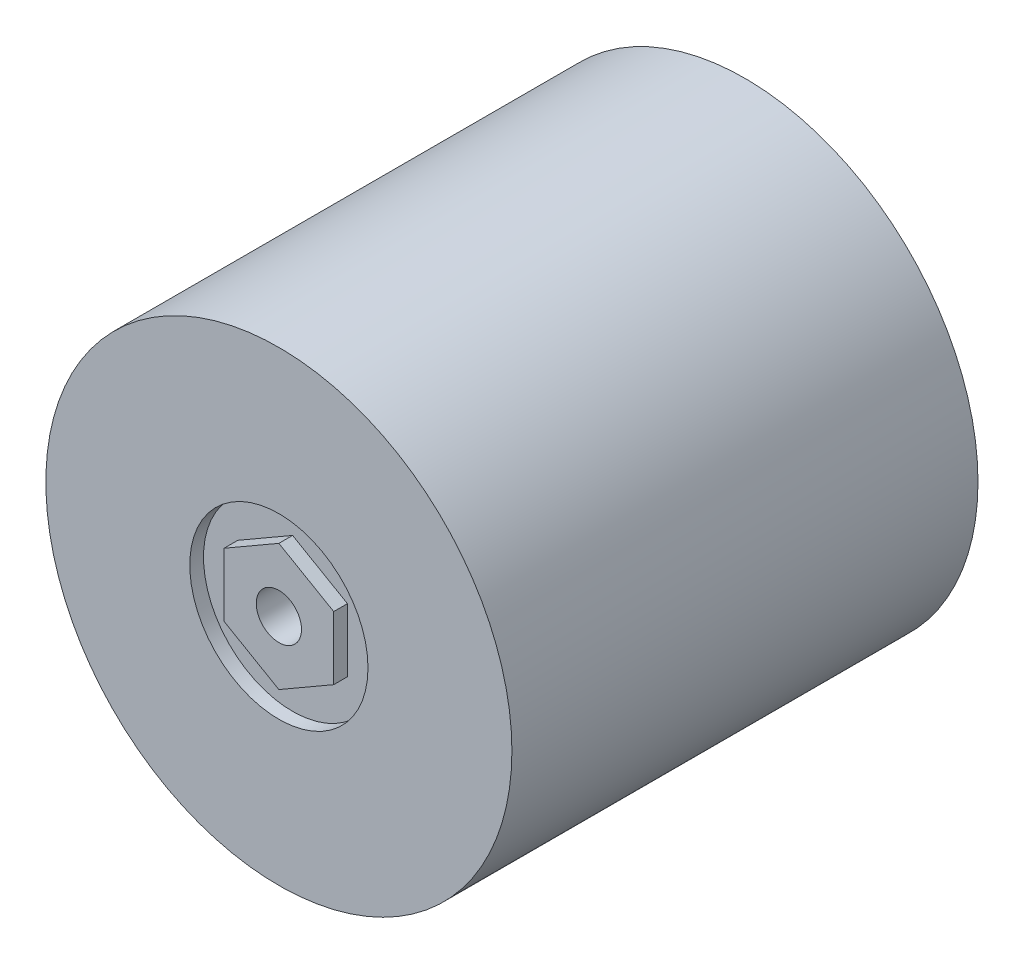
ISO-10303-21;
HEADER;
FILE_DESCRIPTION(('STEP AP214'),'2;1');
FILE_NAME('part.step','',(''),(''),'','','');
FILE_SCHEMA(('AUTOMOTIVE_DESIGN { 1 0 10303 214 1 1 1 1 }'));
ENDSEC;
DATA;
#1=APPLICATION_CONTEXT('core data for automotive mechanical design processes');
#2=APPLICATION_PROTOCOL_DEFINITION('international standard','automotive_design',2000,#1);
#3=PRODUCT_CONTEXT('',#1,'mechanical');
#4=PRODUCT('Part','Part','',(#3));
#5=PRODUCT_RELATED_PRODUCT_CATEGORY('part','',(#4));
#6=PRODUCT_DEFINITION_FORMATION('','',#4);
#7=PRODUCT_DEFINITION_CONTEXT('part definition',#1,'design');
#8=PRODUCT_DEFINITION('design','',#6,#7);
#9=PRODUCT_DEFINITION_SHAPE('','',#8);
#10=(LENGTH_UNIT() NAMED_UNIT(*) SI_UNIT(.MILLI.,.METRE.));
#11=(NAMED_UNIT(*) PLANE_ANGLE_UNIT() SI_UNIT($,.RADIAN.));
#12=(NAMED_UNIT(*) SI_UNIT($,.STERADIAN.) SOLID_ANGLE_UNIT());
#13=UNCERTAINTY_MEASURE_WITH_UNIT(LENGTH_MEASURE(1.E-05),#10,'distance_accuracy_value','');
#14=(GEOMETRIC_REPRESENTATION_CONTEXT(3) GLOBAL_UNCERTAINTY_ASSIGNED_CONTEXT((#13)) GLOBAL_UNIT_ASSIGNED_CONTEXT((#10,
#11,#12)) REPRESENTATION_CONTEXT('',''));
#15=CARTESIAN_POINT('',(0.,0.,0.));
#16=DIRECTION('',(0.,0.,1.));
#17=DIRECTION('',(1.,0.,0.));
#18=AXIS2_PLACEMENT_3D('',#15,#16,#17);
#19=CARTESIAN_POINT('',(0.,0.,34.));
#20=DIRECTION('',(0.,0.,1.));
#21=DIRECTION('',(1.,0.,0.));
#22=AXIS2_PLACEMENT_3D('',#19,#20,#21);
#23=PLANE('',#22);
#24=CARTESIAN_POINT('',(0.,0.,34.));
#25=DIRECTION('',(0.,0.,1.));
#26=DIRECTION('',(1.,0.,0.));
#27=AXIS2_PLACEMENT_3D('',#24,#25,#26);
#28=CIRCLE('',#27,6.5);
#29=CARTESIAN_POINT('',(6.5,0.,34.));
#30=VERTEX_POINT('',#29);
#31=EDGE_CURVE('E119',#30,#30,#28,.T.);
#32=ORIENTED_EDGE('',*,*,#31,.F.);
#33=EDGE_LOOP('',(#32));
#34=FACE_BOUND('',#33,.T.);
#35=CARTESIAN_POINT('',(0.,0.,34.));
#36=DIRECTION('',(0.,0.,1.));
#37=DIRECTION('',(1.,0.,0.));
#38=AXIS2_PLACEMENT_3D('',#35,#36,#37);
#39=CIRCLE('',#38,17.);
#40=CARTESIAN_POINT('',(17.,0.,34.));
#41=VERTEX_POINT('',#40);
#42=EDGE_CURVE('E19',#41,#41,#39,.F.);
#43=ORIENTED_EDGE('',*,*,#42,.F.);
#44=EDGE_LOOP('',(#43));
#45=FACE_BOUND('',#44,.T.);
#46=ADVANCED_FACE('F16',(#34,#45),#23,.T.);
#47=CARTESIAN_POINT('',(0.,0.,0.));
#48=DIRECTION('',(0.,0.,1.));
#49=DIRECTION('',(1.,0.,0.));
#50=AXIS2_PLACEMENT_3D('',#47,#48,#49);
#51=PLANE('',#50);
#52=CARTESIAN_POINT('',(0.,0.,0.));
#53=DIRECTION('',(0.,0.,-1.));
#54=DIRECTION('',(-1.,0.,0.));
#55=AXIS2_PLACEMENT_3D('',#52,#53,#54);
#56=CIRCLE('',#55,15.);
#57=CARTESIAN_POINT('',(-15.,0.,0.));
#58=VERTEX_POINT('',#57);
#59=EDGE_CURVE('E142',#58,#58,#56,.T.);
#60=ORIENTED_EDGE('',*,*,#59,.F.);
#61=EDGE_LOOP('',(#60));
#62=FACE_BOUND('',#61,.T.);
#63=CARTESIAN_POINT('',(0.,0.,0.));
#64=DIRECTION('',(0.,0.,1.));
#65=DIRECTION('',(1.,0.,0.));
#66=AXIS2_PLACEMENT_3D('',#63,#64,#65);
#67=CIRCLE('',#66,17.);
#68=CARTESIAN_POINT('',(17.,0.,0.));
#69=VERTEX_POINT('',#68);
#70=EDGE_CURVE('E11',#69,#69,#67,.T.);
#71=ORIENTED_EDGE('',*,*,#70,.F.);
#72=EDGE_LOOP('',(#71));
#73=FACE_BOUND('',#72,.T.);
#74=ADVANCED_FACE('F153',(#62,#73),#51,.F.);
#75=CARTESIAN_POINT('',(0.,0.,34.));
#76=DIRECTION('',(0.,0.,1.));
#77=DIRECTION('',(1.,0.,0.));
#78=AXIS2_PLACEMENT_3D('',#75,#76,#77);
#79=CYLINDRICAL_SURFACE('',#78,17.);
#80=ORIENTED_EDGE('',*,*,#70,.T.);
#81=EDGE_LOOP('',(#80));
#82=FACE_BOUND('',#81,.T.);
#83=ORIENTED_EDGE('',*,*,#42,.T.);
#84=EDGE_LOOP('',(#83));
#85=FACE_BOUND('',#84,.T.);
#86=ADVANCED_FACE('F156',(#82,#85),#79,.T.);
#87=CARTESIAN_POINT('',(0.,0.,1.));
#88=DIRECTION('',(0.,0.,-1.));
#89=DIRECTION('',(-1.,0.,0.));
#90=AXIS2_PLACEMENT_3D('',#87,#88,#89);
#91=CYLINDRICAL_SURFACE('',#90,15.);
#92=CARTESIAN_POINT('',(0.,0.,1.));
#93=DIRECTION('',(0.,0.,-1.));
#94=DIRECTION('',(-1.,0.,0.));
#95=AXIS2_PLACEMENT_3D('',#92,#93,#94);
#96=CIRCLE('',#95,15.);
#97=CARTESIAN_POINT('',(-15.,0.,1.));
#98=VERTEX_POINT('',#97);
#99=EDGE_CURVE('E145',#98,#98,#96,.T.);
#100=ORIENTED_EDGE('',*,*,#99,.F.);
#101=EDGE_LOOP('',(#100));
#102=FACE_BOUND('',#101,.T.);
#103=ORIENTED_EDGE('',*,*,#59,.T.);
#104=EDGE_LOOP('',(#103));
#105=FACE_BOUND('',#104,.T.);
#106=ADVANCED_FACE('F151',(#102,#105),#91,.F.);
#107=CARTESIAN_POINT('',(0.,0.,1.));
#108=DIRECTION('',(0.,0.,-1.));
#109=DIRECTION('',(-1.,0.,0.));
#110=AXIS2_PLACEMENT_3D('',#107,#108,#109);
#111=PLANE('',#110);
#112=CARTESIAN_POINT('',(0.,0.,1.));
#113=DIRECTION('',(0.,0.,-1.));
#114=DIRECTION('',(-1.,0.,0.));
#115=AXIS2_PLACEMENT_3D('',#112,#113,#114);
#116=CIRCLE('',#115,7.);
#117=CARTESIAN_POINT('',(-7.,0.,1.));
#118=VERTEX_POINT('',#117);
#119=EDGE_CURVE('E139',#118,#118,#116,.T.);
#120=ORIENTED_EDGE('',*,*,#119,.F.);
#121=EDGE_LOOP('',(#120));
#122=FACE_BOUND('',#121,.T.);
#123=ORIENTED_EDGE('',*,*,#99,.T.);
#124=EDGE_LOOP('',(#123));
#125=FACE_BOUND('',#124,.T.);
#126=ADVANCED_FACE('F178',(#122,#125),#111,.T.);
#127=CARTESIAN_POINT('',(0.,0.,1.));
#128=DIRECTION('',(0.,0.,-1.));
#129=DIRECTION('',(-1.,0.,0.));
#130=AXIS2_PLACEMENT_3D('',#127,#128,#129);
#131=CYLINDRICAL_SURFACE('',#130,7.);
#132=ORIENTED_EDGE('',*,*,#119,.T.);
#133=EDGE_LOOP('',(#132));
#134=FACE_BOUND('',#133,.T.);
#135=CARTESIAN_POINT('',(0.,0.,0.));
#136=DIRECTION('',(0.,0.,-1.));
#137=DIRECTION('',(-1.,0.,0.));
#138=AXIS2_PLACEMENT_3D('',#135,#136,#137);
#139=CIRCLE('',#138,7.);
#140=CARTESIAN_POINT('',(-7.,0.,0.));
#141=VERTEX_POINT('',#140);
#142=EDGE_CURVE('E138',#141,#141,#139,.T.);
#143=ORIENTED_EDGE('',*,*,#142,.F.);
#144=EDGE_LOOP('',(#143));
#145=FACE_BOUND('',#144,.T.);
#146=ADVANCED_FACE('F185',(#134,#145),#131,.T.);
#147=ORIENTED_EDGE('',*,*,#142,.T.);
#148=EDGE_LOOP('',(#147));
#149=FACE_BOUND('',#148,.T.);
#150=ADVANCED_FACE('F157',(#149),#51,.F.);
#151=CARTESIAN_POINT('',(0.,0.,33.));
#152=DIRECTION('',(0.,0.,1.));
#153=DIRECTION('',(1.,0.,0.));
#154=AXIS2_PLACEMENT_3D('',#151,#152,#153);
#155=CYLINDRICAL_SURFACE('',#154,6.5);
#156=CARTESIAN_POINT('',(0.,0.,33.));
#157=DIRECTION('',(0.,0.,1.));
#158=DIRECTION('',(1.,0.,0.));
#159=AXIS2_PLACEMENT_3D('',#156,#157,#158);
#160=CIRCLE('',#159,6.5);
#161=CARTESIAN_POINT('',(6.5,0.,33.));
#162=VERTEX_POINT('',#161);
#163=EDGE_CURVE('E127',#162,#162,#160,.T.);
#164=ORIENTED_EDGE('',*,*,#163,.F.);
#165=EDGE_LOOP('',(#164));
#166=FACE_BOUND('',#165,.T.);
#167=ORIENTED_EDGE('',*,*,#31,.T.);
#168=EDGE_LOOP('',(#167));
#169=FACE_BOUND('',#168,.T.);
#170=ADVANCED_FACE('F199',(#166,#169),#155,.F.);
#171=CARTESIAN_POINT('',(0.,0.,33.));
#172=DIRECTION('',(0.,0.,1.));
#173=DIRECTION('',(1.,0.,0.));
#174=AXIS2_PLACEMENT_3D('',#171,#172,#173);
#175=PLANE('',#174);
#176=DIRECTION('',(0.,-1.,0.));
#177=VECTOR('',#176,1.);
#178=CARTESIAN_POINT('',(-4.,2.30940107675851,33.));
#179=LINE('',#178,#177);
#180=CARTESIAN_POINT('',(-4.,2.30940107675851,33.));
#181=VERTEX_POINT('',#180);
#182=CARTESIAN_POINT('',(-4.,-2.30940107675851,33.));
#183=VERTEX_POINT('',#182);
#184=EDGE_CURVE('E80',#181,#183,#179,.T.);
#185=ORIENTED_EDGE('',*,*,#184,.F.);
#186=DIRECTION('',(-0.866025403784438,-0.5,0.));
#187=VECTOR('',#186,1.);
#188=CARTESIAN_POINT('',(0.,4.61880215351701,33.));
#189=LINE('',#188,#187);
#190=CARTESIAN_POINT('',(0.,4.61880215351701,33.));
#191=VERTEX_POINT('',#190);
#192=EDGE_CURVE('E105',#191,#181,#189,.T.);
#193=ORIENTED_EDGE('',*,*,#192,.F.);
#194=DIRECTION('',(-0.866025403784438,0.5,0.));
#195=VECTOR('',#194,1.);
#196=CARTESIAN_POINT('',(4.,2.30940107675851,33.));
#197=LINE('',#196,#195);
#198=CARTESIAN_POINT('',(4.,2.30940107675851,33.));
#199=VERTEX_POINT('',#198);
#200=EDGE_CURVE('E102',#199,#191,#197,.T.);
#201=ORIENTED_EDGE('',*,*,#200,.F.);
#202=DIRECTION('',(0.,1.,0.));
#203=VECTOR('',#202,1.);
#204=CARTESIAN_POINT('',(4.,-2.30940107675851,33.));
#205=LINE('',#204,#203);
#206=CARTESIAN_POINT('',(4.,-2.30940107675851,33.));
#207=VERTEX_POINT('',#206);
#208=EDGE_CURVE('E91',#207,#199,#205,.T.);
#209=ORIENTED_EDGE('',*,*,#208,.F.);
#210=DIRECTION('',(0.866025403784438,0.5,0.));
#211=VECTOR('',#210,1.);
#212=CARTESIAN_POINT('',(0.,-4.61880215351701,33.));
#213=LINE('',#212,#211);
#214=CARTESIAN_POINT('',(0.,-4.61880215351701,33.));
#215=VERTEX_POINT('',#214);
#216=EDGE_CURVE('E72',#215,#207,#213,.T.);
#217=ORIENTED_EDGE('',*,*,#216,.F.);
#218=DIRECTION('',(0.866025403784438,-0.5,0.));
#219=VECTOR('',#218,1.);
#220=CARTESIAN_POINT('',(-4.,-2.30940107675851,33.));
#221=LINE('',#220,#219);
#222=EDGE_CURVE('E87',#183,#215,#221,.T.);
#223=ORIENTED_EDGE('',*,*,#222,.F.);
#224=EDGE_LOOP('',(#185,#193,#201,#209,#217,#223));
#225=FACE_BOUND('',#224,.T.);
#226=ORIENTED_EDGE('',*,*,#163,.T.);
#227=EDGE_LOOP('',(#226));
#228=FACE_BOUND('',#227,.T.);
#229=ADVANCED_FACE('F85',(#225,#228),#175,.T.);
#230=CARTESIAN_POINT('',(-4.,-2.30940107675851,33.));
#231=DIRECTION('',(-0.5,-0.866025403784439,0.));
#232=DIRECTION('',(0.866025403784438,-0.5,0.));
#233=AXIS2_PLACEMENT_3D('',#230,#231,#232);
#234=PLANE('',#233);
#235=DIRECTION('',(0.866025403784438,-0.5,0.));
#236=VECTOR('',#235,1.);
#237=CARTESIAN_POINT('',(-4.,-2.30940107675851,34.));
#238=LINE('',#237,#236);
#239=CARTESIAN_POINT('',(-4.,-2.30940107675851,34.));
#240=VERTEX_POINT('',#239);
#241=CARTESIAN_POINT('',(0.,-4.61880215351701,34.));
#242=VERTEX_POINT('',#241);
#243=EDGE_CURVE('E109',#240,#242,#238,.T.);
#244=ORIENTED_EDGE('',*,*,#243,.F.);
#245=DIRECTION('',(0.,0.,1.));
#246=VECTOR('',#245,1.);
#247=CARTESIAN_POINT('',(-4.,-2.30940107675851,33.));
#248=LINE('',#247,#246);
#249=EDGE_CURVE('E94',#183,#240,#248,.T.);
#250=ORIENTED_EDGE('',*,*,#249,.F.);
#251=ORIENTED_EDGE('',*,*,#222,.T.);
#252=DIRECTION('',(0.,0.,1.));
#253=VECTOR('',#252,1.);
#254=CARTESIAN_POINT('',(0.,-4.61880215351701,33.));
#255=LINE('',#254,#253);
#256=EDGE_CURVE('E69',#215,#242,#255,.T.);
#257=ORIENTED_EDGE('',*,*,#256,.T.);
#258=EDGE_LOOP('',(#244,#250,#251,#257));
#259=FACE_BOUND('',#258,.T.);
#260=ADVANCED_FACE('F93',(#259),#234,.T.);
#261=CARTESIAN_POINT('',(-4.,2.30940107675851,33.));
#262=DIRECTION('',(-1.,0.,0.));
#263=DIRECTION('',(0.,-1.,0.));
#264=AXIS2_PLACEMENT_3D('',#261,#262,#263);
#265=PLANE('',#264);
#266=DIRECTION('',(0.,-1.,0.));
#267=VECTOR('',#266,1.);
#268=CARTESIAN_POINT('',(-4.,2.30940107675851,34.));
#269=LINE('',#268,#267);
#270=CARTESIAN_POINT('',(-4.,2.30940107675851,34.));
#271=VERTEX_POINT('',#270);
#272=EDGE_CURVE('E95',#271,#240,#269,.T.);
#273=ORIENTED_EDGE('',*,*,#272,.F.);
#274=DIRECTION('',(0.,0.,1.));
#275=VECTOR('',#274,1.);
#276=CARTESIAN_POINT('',(-4.,2.30940107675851,33.));
#277=LINE('',#276,#275);
#278=EDGE_CURVE('E120',#181,#271,#277,.T.);
#279=ORIENTED_EDGE('',*,*,#278,.F.);
#280=ORIENTED_EDGE('',*,*,#184,.T.);
#281=ORIENTED_EDGE('',*,*,#249,.T.);
#282=EDGE_LOOP('',(#273,#279,#280,#281));
#283=FACE_BOUND('',#282,.T.);
#284=ADVANCED_FACE('F207',(#283),#265,.T.);
#285=CARTESIAN_POINT('',(0.,4.61880215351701,33.));
#286=DIRECTION('',(-0.5,0.866025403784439,0.));
#287=DIRECTION('',(-0.866025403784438,-0.5,0.));
#288=AXIS2_PLACEMENT_3D('',#285,#286,#287);
#289=PLANE('',#288);
#290=DIRECTION('',(-0.866025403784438,-0.5,0.));
#291=VECTOR('',#290,1.);
#292=CARTESIAN_POINT('',(0.,4.61880215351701,34.));
#293=LINE('',#292,#291);
#294=CARTESIAN_POINT('',(0.,4.61880215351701,34.));
#295=VERTEX_POINT('',#294);
#296=EDGE_CURVE('E98',#295,#271,#293,.T.);
#297=ORIENTED_EDGE('',*,*,#296,.F.);
#298=DIRECTION('',(0.,0.,1.));
#299=VECTOR('',#298,1.);
#300=CARTESIAN_POINT('',(0.,4.61880215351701,33.));
#301=LINE('',#300,#299);
#302=EDGE_CURVE('E122',#191,#295,#301,.T.);
#303=ORIENTED_EDGE('',*,*,#302,.F.);
#304=ORIENTED_EDGE('',*,*,#192,.T.);
#305=ORIENTED_EDGE('',*,*,#278,.T.);
#306=EDGE_LOOP('',(#297,#303,#304,#305));
#307=FACE_BOUND('',#306,.T.);
#308=ADVANCED_FACE('F216',(#307),#289,.T.);
#309=CARTESIAN_POINT('',(4.,2.30940107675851,33.));
#310=DIRECTION('',(0.5,0.866025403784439,0.));
#311=DIRECTION('',(-0.866025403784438,0.5,0.));
#312=AXIS2_PLACEMENT_3D('',#309,#310,#311);
#313=PLANE('',#312);
#314=DIRECTION('',(-0.866025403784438,0.5,0.));
#315=VECTOR('',#314,1.);
#316=CARTESIAN_POINT('',(4.,2.30940107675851,34.));
#317=LINE('',#316,#315);
#318=CARTESIAN_POINT('',(4.,2.30940107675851,34.));
#319=VERTEX_POINT('',#318);
#320=EDGE_CURVE('E113',#319,#295,#317,.T.);
#321=ORIENTED_EDGE('',*,*,#320,.F.);
#322=DIRECTION('',(0.,0.,1.));
#323=VECTOR('',#322,1.);
#324=CARTESIAN_POINT('',(4.,2.30940107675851,33.));
#325=LINE('',#324,#323);
#326=EDGE_CURVE('E124',#199,#319,#325,.T.);
#327=ORIENTED_EDGE('',*,*,#326,.F.);
#328=ORIENTED_EDGE('',*,*,#200,.T.);
#329=ORIENTED_EDGE('',*,*,#302,.T.);
#330=EDGE_LOOP('',(#321,#327,#328,#329));
#331=FACE_BOUND('',#330,.T.);
#332=ADVANCED_FACE('F213',(#331),#313,.T.);
#333=CARTESIAN_POINT('',(4.,-2.30940107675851,33.));
#334=DIRECTION('',(1.,0.,0.));
#335=DIRECTION('',(0.,0.,-1.));
#336=AXIS2_PLACEMENT_3D('',#333,#334,#335);
#337=PLANE('',#336);
#338=DIRECTION('',(0.,1.,0.));
#339=VECTOR('',#338,1.);
#340=CARTESIAN_POINT('',(4.,-2.30940107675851,34.));
#341=LINE('',#340,#339);
#342=CARTESIAN_POINT('',(4.,-2.30940107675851,34.));
#343=VERTEX_POINT('',#342);
#344=EDGE_CURVE('E30',#343,#319,#341,.T.);
#345=ORIENTED_EDGE('',*,*,#344,.F.);
#346=DIRECTION('',(0.,0.,1.));
#347=VECTOR('',#346,1.);
#348=CARTESIAN_POINT('',(4.,-2.30940107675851,33.));
#349=LINE('',#348,#347);
#350=EDGE_CURVE('E79',#207,#343,#349,.T.);
#351=ORIENTED_EDGE('',*,*,#350,.F.);
#352=ORIENTED_EDGE('',*,*,#208,.T.);
#353=ORIENTED_EDGE('',*,*,#326,.T.);
#354=EDGE_LOOP('',(#345,#351,#352,#353));
#355=FACE_BOUND('',#354,.T.);
#356=ADVANCED_FACE('F210',(#355),#337,.T.);
#357=CARTESIAN_POINT('',(0.,-4.61880215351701,33.));
#358=DIRECTION('',(0.5,-0.866025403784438,0.));
#359=DIRECTION('',(0.866025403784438,0.5,0.));
#360=AXIS2_PLACEMENT_3D('',#357,#358,#359);
#361=PLANE('',#360);
#362=DIRECTION('',(0.866025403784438,0.5,0.));
#363=VECTOR('',#362,1.);
#364=CARTESIAN_POINT('',(0.,-4.61880215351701,34.));
#365=LINE('',#364,#363);
#366=EDGE_CURVE('E74',#242,#343,#365,.T.);
#367=ORIENTED_EDGE('',*,*,#366,.F.);
#368=ORIENTED_EDGE('',*,*,#256,.F.);
#369=ORIENTED_EDGE('',*,*,#216,.T.);
#370=ORIENTED_EDGE('',*,*,#350,.T.);
#371=EDGE_LOOP('',(#367,#368,#369,#370));
#372=FACE_BOUND('',#371,.T.);
#373=ADVANCED_FACE('F71',(#372),#361,.T.);
#374=CARTESIAN_POINT('',(0.,0.,22.));
#375=DIRECTION('',(0.,0.,1.));
#376=DIRECTION('',(1.,0.,0.));
#377=AXIS2_PLACEMENT_3D('',#374,#375,#376);
#378=CONICAL_SURFACE('',#377,1.65,1.02974425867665);
#379=CARTESIAN_POINT('',(0.,0.,21.0085799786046));
#380=VERTEX_POINT('',#379);
#381=VERTEX_LOOP('',#380);
#382=FACE_BOUND('',#381,.T.);
#383=CARTESIAN_POINT('',(0.,0.,22.));
#384=DIRECTION('',(0.,0.,1.));
#385=DIRECTION('',(1.,0.,0.));
#386=AXIS2_PLACEMENT_3D('',#383,#384,#385);
#387=CIRCLE('',#386,1.65);
#388=CARTESIAN_POINT('',(1.65,0.,22.));
#389=VERTEX_POINT('',#388);
#390=EDGE_CURVE('E135',#389,#389,#387,.T.);
#391=ORIENTED_EDGE('',*,*,#390,.T.);
#392=EDGE_LOOP('',(#391));
#393=FACE_BOUND('',#392,.T.);
#394=ADVANCED_FACE('F193',(#382,#393),#378,.F.);
#395=CARTESIAN_POINT('',(0.,0.,34.));
#396=DIRECTION('',(0.,0.,1.));
#397=DIRECTION('',(1.,0.,0.));
#398=AXIS2_PLACEMENT_3D('',#395,#396,#397);
#399=CYLINDRICAL_SURFACE('',#398,1.65);
#400=ORIENTED_EDGE('',*,*,#390,.F.);
#401=EDGE_LOOP('',(#400));
#402=FACE_BOUND('',#401,.T.);
#403=CARTESIAN_POINT('',(0.,0.,34.));
#404=DIRECTION('',(0.,0.,1.));
#405=DIRECTION('',(1.,0.,0.));
#406=AXIS2_PLACEMENT_3D('',#403,#404,#405);
#407=CIRCLE('',#406,1.65);
#408=CARTESIAN_POINT('',(1.65,0.,34.));
#409=VERTEX_POINT('',#408);
#410=EDGE_CURVE('E130',#409,#409,#407,.T.);
#411=ORIENTED_EDGE('',*,*,#410,.T.);
#412=EDGE_LOOP('',(#411));
#413=FACE_BOUND('',#412,.T.);
#414=ADVANCED_FACE('F175',(#402,#413),#399,.F.);
#415=ORIENTED_EDGE('',*,*,#410,.F.);
#416=EDGE_LOOP('',(#415));
#417=FACE_BOUND('',#416,.T.);
#418=ORIENTED_EDGE('',*,*,#272,.T.);
#419=ORIENTED_EDGE('',*,*,#243,.T.);
#420=ORIENTED_EDGE('',*,*,#366,.T.);
#421=ORIENTED_EDGE('',*,*,#344,.T.);
#422=ORIENTED_EDGE('',*,*,#320,.T.);
#423=ORIENTED_EDGE('',*,*,#296,.T.);
#424=EDGE_LOOP('',(#418,#419,#420,#421,#422,#423));
#425=FACE_BOUND('',#424,.T.);
#426=ADVANCED_FACE('F168',(#417,#425),#23,.T.);
#427=CLOSED_SHELL('',(#46,#74,#86,#106,#126,#146,#150,#170,#229,#260,#284,#308,#332,#356,#373,
#394,#414,#426));
#428=MANIFOLD_SOLID_BREP('B1',#427);
#429=ADVANCED_BREP_SHAPE_REPRESENTATION('',(#18,#428),#14);
#430=SHAPE_DEFINITION_REPRESENTATION(#9,#429);
ENDSEC;
END-ISO-10303-21;
